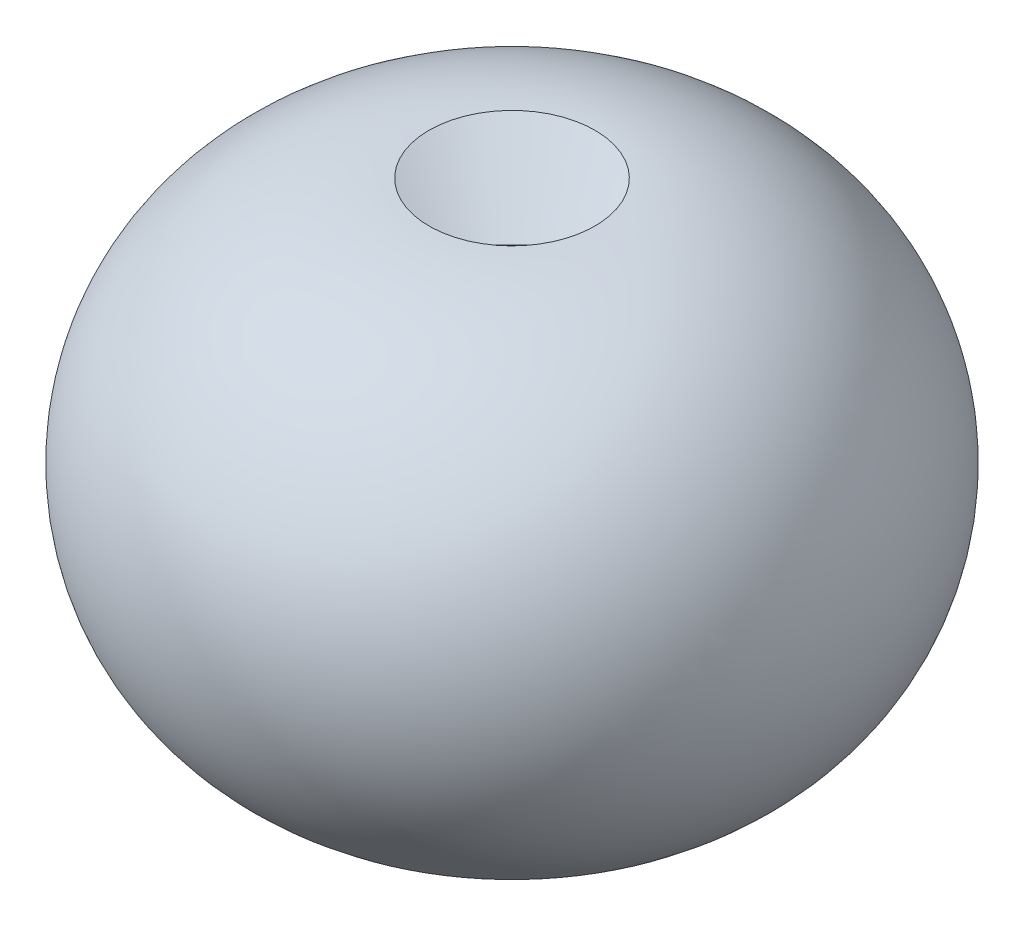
ISO-10303-21;
HEADER;
FILE_DESCRIPTION(('STEP AP214'),'2;1');
FILE_NAME('part.step','',(''),(''),'','','');
FILE_SCHEMA(('AUTOMOTIVE_DESIGN { 1 0 10303 214 1 1 1 1 }'));
ENDSEC;
DATA;
#1=APPLICATION_CONTEXT('core data for automotive mechanical design processes');
#2=APPLICATION_PROTOCOL_DEFINITION('international standard','automotive_design',2000,#1);
#3=PRODUCT_CONTEXT('',#1,'mechanical');
#4=PRODUCT('Part','Part','',(#3));
#5=PRODUCT_RELATED_PRODUCT_CATEGORY('part','',(#4));
#6=PRODUCT_DEFINITION_FORMATION('','',#4);
#7=PRODUCT_DEFINITION_CONTEXT('part definition',#1,'design');
#8=PRODUCT_DEFINITION('design','',#6,#7);
#9=PRODUCT_DEFINITION_SHAPE('','',#8);
#10=(LENGTH_UNIT() NAMED_UNIT(*) SI_UNIT(.MILLI.,.METRE.));
#11=(NAMED_UNIT(*) PLANE_ANGLE_UNIT() SI_UNIT($,.RADIAN.));
#12=(NAMED_UNIT(*) SI_UNIT($,.STERADIAN.) SOLID_ANGLE_UNIT());
#13=UNCERTAINTY_MEASURE_WITH_UNIT(LENGTH_MEASURE(1.E-05),#10,'distance_accuracy_value','');
#14=(GEOMETRIC_REPRESENTATION_CONTEXT(3) GLOBAL_UNCERTAINTY_ASSIGNED_CONTEXT((#13)) GLOBAL_UNIT_ASSIGNED_CONTEXT((#10,
#11,#12)) REPRESENTATION_CONTEXT('',''));
#15=CARTESIAN_POINT('',(0.,0.,0.));
#16=DIRECTION('',(0.,0.,1.));
#17=DIRECTION('',(1.,0.,0.));
#18=AXIS2_PLACEMENT_3D('',#15,#16,#17);
#19=CARTESIAN_POINT('',(-2.71359835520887E-13,2625.59111750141,0.));
#20=DIRECTION('',(0.,-1.,0.));
#21=DIRECTION('',(1.,0.,0.));
#22=AXIS2_PLACEMENT_3D('',#19,#20,#21);
#23=CONICAL_SURFACE('',#22,1544.05252580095,1.04603878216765);
#24=CARTESIAN_POINT('',(-3.00133257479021E-13,3027.37557723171,0.));
#25=DIRECTION('',(0.,1.,0.));
#26=DIRECTION('',(-1.,0.,0.));
#27=AXIS2_PLACEMENT_3D('',#24,#25,#26);
#28=CIRCLE('',#27,850.);
#29=CARTESIAN_POINT('',(-850.,3027.37557723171,0.));
#30=VERTEX_POINT('',#29);
#31=EDGE_CURVE('E11',#30,#30,#28,.T.);
#32=ORIENTED_EDGE('',*,*,#31,.T.);
#33=EDGE_LOOP('',(#32));
#34=FACE_BOUND('',#33,.T.);
#35=CARTESIAN_POINT('',(-2.71359835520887E-13,2625.59111750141,0.));
#36=DIRECTION('',(0.,1.,0.));
#37=DIRECTION('',(-1.,0.,0.));
#38=AXIS2_PLACEMENT_3D('',#35,#36,#37);
#39=CIRCLE('',#38,1544.05252580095);
#40=CARTESIAN_POINT('',(-1544.05252580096,2625.59111750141,0.));
#41=VERTEX_POINT('',#40);
#42=EDGE_CURVE('E59',#41,#41,#39,.T.);
#43=ORIENTED_EDGE('',*,*,#42,.F.);
#44=EDGE_LOOP('',(#43));
#45=FACE_BOUND('',#44,.T.);
#46=ADVANCED_FACE('F16',(#34,#45),#23,.F.);
#47=CARTESIAN_POINT('',(-2.22044604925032E-13,500.,0.));
#48=DIRECTION('',(0.,1.,0.));
#49=DIRECTION('',(-1.,0.,0.));
#50=AXIS2_PLACEMENT_3D('',#47,#48,#49);
#51=DEGENERATE_TOROIDAL_SURFACE('',#50,850.,2527.37557723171,.T.);
#52=CARTESIAN_POINT('',(0.,-2027.2139582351,0.));
#53=DIRECTION('',(0.,1.,0.));
#54=DIRECTION('',(-1.,0.,0.));
#55=AXIS2_PLACEMENT_3D('',#52,#53,#54);
#56=CIRCLE('',#55,821.418228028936);
#57=CARTESIAN_POINT('',(-821.418228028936,-2027.2139582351,0.));
#58=VERTEX_POINT('',#57);
#59=EDGE_CURVE('E24',#58,#58,#56,.T.);
#60=ORIENTED_EDGE('',*,*,#59,.T.);
#61=EDGE_LOOP('',(#60));
#62=FACE_BOUND('',#61,.T.);
#63=ORIENTED_EDGE('',*,*,#31,.F.);
#64=EDGE_LOOP('',(#63));
#65=FACE_BOUND('',#64,.T.);
#66=ADVANCED_FACE('F34',(#62,#65),#51,.T.);
#67=CARTESIAN_POINT('',(-1054.03660875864,-657.149109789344,0.));
#68=DIRECTION('',(0.,0.,-1.));
#69=DIRECTION('',(-1.,0.,0.));
#70=AXIS2_PLACEMENT_3D('',#67,#68,#69);
#71=CIRCLE('',#70,1389.67226352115);
#72=TRIMMED_CURVE('',#71,(PARAMETER_VALUE(-2.43177167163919)),
(PARAMETER_VALUE(2.43177167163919)),.T.,.PARAMETER.);
#73=CARTESIAN_POINT('',(0.,-657.149109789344,0.));
#74=DIRECTION('',(0.,1.,0.));
#75=AXIS1_PLACEMENT('',#73,#74);
#76=SURFACE_OF_REVOLUTION('',#72,#75);
#77=CARTESIAN_POINT('',(0.,-1562.79574473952,0.));
#78=VERTEX_POINT('',#77);
#79=VERTEX_LOOP('',#78);
#80=FACE_BOUND('',#79,.T.);
#81=ORIENTED_EDGE('',*,*,#59,.F.);
#82=EDGE_LOOP('',(#81));
#83=FACE_BOUND('',#82,.T.);
#84=ADVANCED_FACE('F30',(#80,#83),#76,.T.);
#85=CARTESIAN_POINT('',(0.,-388.462863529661,0.));
#86=DIRECTION('',(0.,1.,0.));
#87=DIRECTION('',(-1.,0.,0.));
#88=AXIS2_PLACEMENT_3D('',#85,#86,#87);
#89=CONICAL_SURFACE('',#88,0.,1.31653531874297);
#90=CARTESIAN_POINT('',(0.,-180.554290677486,0.));
#91=DIRECTION('',(0.,1.,0.));
#92=DIRECTION('',(-1.,0.,0.));
#93=AXIS2_PLACEMENT_3D('',#90,#91,#92);
#94=CIRCLE('',#93,800.);
#95=CARTESIAN_POINT('',(-800.,-180.554290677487,0.));
#96=VERTEX_POINT('',#95);
#97=EDGE_CURVE('E40',#96,#96,#94,.T.);
#98=ORIENTED_EDGE('',*,*,#97,.T.);
#99=EDGE_LOOP('',(#98));
#100=FACE_BOUND('',#99,.T.);
#101=CARTESIAN_POINT('',(0.,-388.462863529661,0.));
#102=VERTEX_POINT('',#101);
#103=VERTEX_LOOP('',#102);
#104=FACE_BOUND('',#103,.T.);
#105=ADVANCED_FACE('F33',(#100,#104),#89,.F.);
#106=CARTESIAN_POINT('',(-2.22044604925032E-13,500.,0.));
#107=DIRECTION('',(0.,1.,0.));
#108=DIRECTION('',(-1.,0.,0.));
#109=AXIS2_PLACEMENT_3D('',#106,#107,#108);
#110=TOROIDAL_SURFACE('',#109,850.,682.388556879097);
#111=CARTESIAN_POINT('',(-1.54857375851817E-13,998.781560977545,0.));
#112=DIRECTION('',(0.,1.,0.));
#113=DIRECTION('',(-1.,0.,0.));
#114=AXIS2_PLACEMENT_3D('',#111,#112,#113);
#115=CIRCLE('',#114,1315.6942097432);
#116=CARTESIAN_POINT('',(-1315.6942097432,998.781560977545,0.));
#117=VERTEX_POINT('',#116);
#118=EDGE_CURVE('E46',#117,#117,#115,.T.);
#119=ORIENTED_EDGE('',*,*,#118,.T.);
#120=EDGE_LOOP('',(#119));
#121=FACE_BOUND('',#120,.T.);
#122=ORIENTED_EDGE('',*,*,#97,.F.);
#123=EDGE_LOOP('',(#122));
#124=FACE_BOUND('',#123,.T.);
#125=ADVANCED_FACE('F77',(#121,#124),#110,.F.);
#126=CARTESIAN_POINT('',(-1.66533453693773E-13,1254.70007823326,0.));
#127=DIRECTION('',(0.,1.,0.));
#128=DIRECTION('',(-1.,0.,0.));
#129=AXIS2_PLACEMENT_3D('',#126,#127,#128);
#130=DEGENERATE_TOROIDAL_SURFACE('',#129,192.025792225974,1152.44305716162,.T.);
#131=CARTESIAN_POINT('',(-1.9112946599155E-13,1505.27544138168,0.));
#132=DIRECTION('',(0.,1.,0.));
#133=DIRECTION('',(-1.,0.,0.));
#134=AXIS2_PLACEMENT_3D('',#131,#132,#133);
#135=CIRCLE('',#134,1316.8977793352);
#136=CARTESIAN_POINT('',(-1316.8977793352,1505.27544138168,0.));
#137=VERTEX_POINT('',#136);
#138=EDGE_CURVE('E52',#137,#137,#135,.T.);
#139=ORIENTED_EDGE('',*,*,#138,.T.);
#140=EDGE_LOOP('',(#139));
#141=FACE_BOUND('',#140,.T.);
#142=ORIENTED_EDGE('',*,*,#118,.F.);
#143=EDGE_LOOP('',(#142));
#144=FACE_BOUND('',#143,.T.);
#145=ADVANCED_FACE('F81',(#141,#144),#130,.F.);
#146=CARTESIAN_POINT('',(-1.9112946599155E-13,1505.27544138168,0.));
#147=DIRECTION('',(0.,1.,0.));
#148=DIRECTION('',(-1.,0.,0.));
#149=AXIS2_PLACEMENT_3D('',#146,#147,#148);
#150=CONICAL_SURFACE('',#149,1316.8977793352,0.778092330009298);
#151=CARTESIAN_POINT('',(-2.41916360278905E-13,2214.45021080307,0.));
#152=DIRECTION('',(0.,1.,0.));
#153=DIRECTION('',(-1.,0.,0.));
#154=AXIS2_PLACEMENT_3D('',#151,#152,#153);
#155=CIRCLE('',#154,2015.78529725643);
#156=CARTESIAN_POINT('',(-2015.78529725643,2214.45021080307,0.));
#157=VERTEX_POINT('',#156);
#158=EDGE_CURVE('E55',#157,#157,#155,.T.);
#159=ORIENTED_EDGE('',*,*,#158,.T.);
#160=EDGE_LOOP('',(#159));
#161=FACE_BOUND('',#160,.T.);
#162=ORIENTED_EDGE('',*,*,#138,.F.);
#163=EDGE_LOOP('',(#162));
#164=FACE_BOUND('',#163,.T.);
#165=ADVANCED_FACE('F85',(#161,#164),#150,.F.);
#166=CARTESIAN_POINT('',(-2.41916360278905E-13,2214.45021080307,0.));
#167=DIRECTION('',(0.,-1.,0.));
#168=DIRECTION('',(1.,0.,0.));
#169=AXIS2_PLACEMENT_3D('',#166,#167,#168);
#170=CONICAL_SURFACE('',#169,2015.78529725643,0.853920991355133);
#171=ORIENTED_EDGE('',*,*,#42,.T.);
#172=EDGE_LOOP('',(#171));
#173=FACE_BOUND('',#172,.T.);
#174=ORIENTED_EDGE('',*,*,#158,.F.);
#175=EDGE_LOOP('',(#174));
#176=FACE_BOUND('',#175,.T.);
#177=ADVANCED_FACE('F63',(#173,#176),#170,.F.);
#178=CLOSED_SHELL('',(#46,#66,#84,#105,#125,#145,#165,#177));
#179=MANIFOLD_SOLID_BREP('B1',#178);
#180=ADVANCED_BREP_SHAPE_REPRESENTATION('',(#18,#179),#14);
#181=SHAPE_DEFINITION_REPRESENTATION(#9,#180);
ENDSEC;
END-ISO-10303-21;
